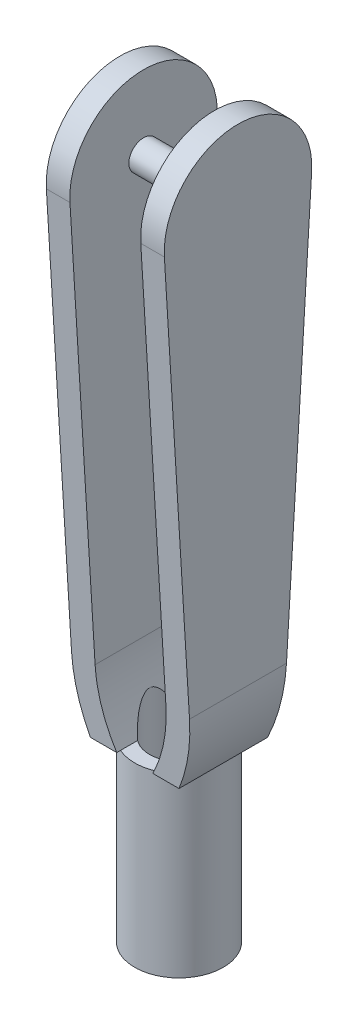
from build123d import *

# Parameters (mm, degrees)
EXTRUSION1_DEPTH        = 6
ENL_V_MAT_EXTRU_1_DEPTH = 21.976176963
ENL_V_MAT_EXTRU_2_DEPTH = 22.260291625
ESQUISSE4_R             = 0.5
EXTRUSION2_DEPTH        = 2.4
ESQUISSE5_R             = 1.5
EXTRUSION3_DEPTH        = 6
ESQUISSE6_R             = 1
ENL_V_MAT_EXTRU_3_DEPTH = 10


with BuildPart() as part:
    # Esquisse1 → Extrusion1 (new body)
    with BuildSketch(Plane.XY):
        with BuildLine():
            Line((-2, 2.355843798), (-2, 20))
            Line((-2, 20), (2, 20))
            Line((2, 20), (2, 2.355843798))
            ThreePointArc((2, 2.355843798), (1.873623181, 1.15168434), (1.5, 0))
            Line((1.5, 0), (-1.5, 0))
            ThreePointArc((-1.5, 0), (-1.873623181, 1.15168434), (-2, 2.355843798))
        make_face()
    extrude(amount=EXTRUSION1_DEPTH)

    # Esquisse2 → Enl_v. mat.-Extru.1 (cut, through all)
    with BuildSketch(Plane.XY.offset(6)):
        with BuildLine():
            Line((-1.2, 20), (-1.2, 2.355843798))
            ThreePointArc((-1.2, 2.355843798), (-1.050313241, 1.14156975), (-0.610215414, 0))
            Line((-0.610215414, 0), (0.610215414, 0))
            ThreePointArc((0.610215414, 0), (1.050313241, 1.14156975), (1.2, 2.355843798))
            Line((1.2, 2.355843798), (1.2, 20))
            Line((1.2, 20), (-1.2, 20))
        make_face()
    extrude(amount=-ENL_V_MAT_EXTRU_1_DEPTH, mode=Mode.SUBTRACT)


with BuildPart() as enl_v_mat_extru_1_piece_1:
    # of the separate pieces the step leaves, piece 1, a body of its own (enl_v_mat_extru_1_pieces)
    add(part.part.solids().sort_by_distance((1.5, 0, 0))[0])


with BuildPart() as enl_v_mat_extru_1_piece_2:
    # of the separate pieces the step leaves, piece 2, a body of its own (enl_v_mat_extru_1_pieces)
    add(part.part.solids().sort_by_distance((-1.5, 0, 0))[0])


with BuildPart() as enl_v_mat_extru_2_tool:
    # Esquisse3 → Enl_v. mat.-Extru.2 (new, through all)
    with BuildSketch(Plane(origin=(2, 0, 0), x_dir=(0, 0, -1), z_dir=(1, 0, 0))):
        with BuildLine():
            Line((-4.5, 0), (-5.495378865, 16.348064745))
            ThreePointArc((-5.495378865, 16.348064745), (-3, 19), (-0.504621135, 16.348064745))
            Line((-0.504621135, 16.348064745), (-1.5, 0))
            Line((-1.5, 0), (0, 0))
            Line((0, 0), (0, 20))
            Line((0, 20), (-6, 20))
            Line((-6, 20), (-6, 0))
            Line((-6, 0), (-4.5, 0))
        make_face()
    extrude(amount=-ENL_V_MAT_EXTRU_2_DEPTH)


with BuildPart() as enl_v_mat_extru_1_piece_1_1:
    add(enl_v_mat_extru_1_piece_1.part)

    # Enl_v. mat.-Extru.2: cut by enl_v_mat_extru_2_tool
    add(enl_v_mat_extru_2_tool.part, mode=Mode.SUBTRACT)



with BuildPart() as enl_v_mat_extru_1_piece_2_1:
    add(enl_v_mat_extru_1_piece_2.part)

    # Enl_v. mat.-Extru.2: cut by enl_v_mat_extru_2_tool
    add(enl_v_mat_extru_2_tool.part, mode=Mode.SUBTRACT)


with BuildPart() as enl_v_mat_extru_1_piece_1_2:
    add(enl_v_mat_extru_1_piece_1_1.part)

    add(enl_v_mat_extru_1_piece_2_1.part)  # Extrusion2 merges Enl_v. mat.-Extru.1 piece 2
    # Esquisse4 → Extrusion2 (add)
    with BuildSketch(Plane(origin=(-1.2, 0, 0), x_dir=(0, 0, -1), z_dir=(1, 0, 0))):
        with Locations(Location((-3, 16.5, 0), (0, 0, 180))):
            Circle(ESQUISSE4_R)
    extrude(amount=EXTRUSION2_DEPTH)

    # Esquisse5 → Extrusion3 (add)
    with BuildSketch(Plane.XZ):
        with Locations(Location((0, 3, 0), (0, 0, 65.995381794))):
            Circle(ESQUISSE5_R)
    extrude(amount=EXTRUSION3_DEPTH)

    # Esquisse6 → Enl_v. mat.-Extru.3 (cut)
    with BuildSketch(Plane.XZ.offset(6)):
        with Locations(Location((0, 3, 0), (0, 0, 270))):
            Circle(ESQUISSE6_R)
    extrude(amount=-ENL_V_MAT_EXTRU_3_DEPTH, mode=Mode.SUBTRACT)


solid = enl_v_mat_extru_1_piece_1_2.part
